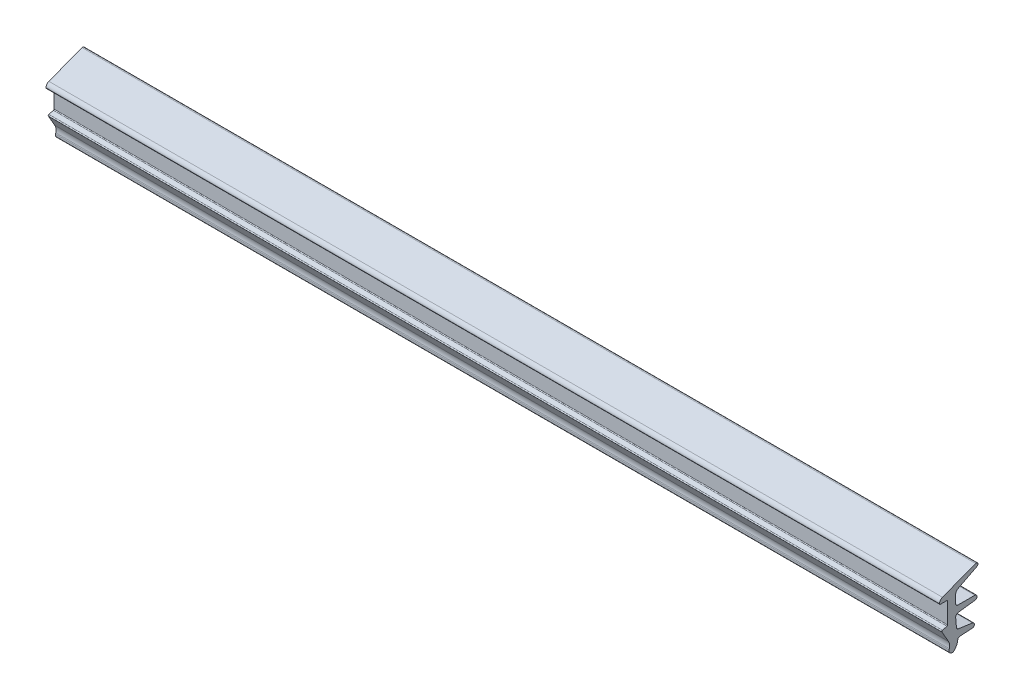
ISO-10303-21;
HEADER;
FILE_DESCRIPTION(('STEP AP214'),'2;1');
FILE_NAME('part.step','',(''),(''),'','','');
FILE_SCHEMA(('AUTOMOTIVE_DESIGN { 1 0 10303 214 1 1 1 1 }'));
ENDSEC;
DATA;
#1=APPLICATION_CONTEXT('core data for automotive mechanical design processes');
#2=APPLICATION_PROTOCOL_DEFINITION('international standard','automotive_design',2000,#1);
#3=PRODUCT_CONTEXT('',#1,'mechanical');
#4=PRODUCT('Part','Part','',(#3));
#5=PRODUCT_RELATED_PRODUCT_CATEGORY('part','',(#4));
#6=PRODUCT_DEFINITION_FORMATION('','',#4);
#7=PRODUCT_DEFINITION_CONTEXT('part definition',#1,'design');
#8=PRODUCT_DEFINITION('design','',#6,#7);
#9=PRODUCT_DEFINITION_SHAPE('','',#8);
#10=(LENGTH_UNIT() NAMED_UNIT(*) SI_UNIT(.MILLI.,.METRE.));
#11=(NAMED_UNIT(*) PLANE_ANGLE_UNIT() SI_UNIT($,.RADIAN.));
#12=(NAMED_UNIT(*) SI_UNIT($,.STERADIAN.) SOLID_ANGLE_UNIT());
#13=UNCERTAINTY_MEASURE_WITH_UNIT(LENGTH_MEASURE(1.E-05),#10,'distance_accuracy_value','');
#14=(GEOMETRIC_REPRESENTATION_CONTEXT(3) GLOBAL_UNCERTAINTY_ASSIGNED_CONTEXT((#13)) GLOBAL_UNIT_ASSIGNED_CONTEXT((#10,
#11,#12)) REPRESENTATION_CONTEXT('',''));
#15=CARTESIAN_POINT('',(0.,0.,0.));
#16=DIRECTION('',(0.,0.,1.));
#17=DIRECTION('',(1.,0.,0.));
#18=AXIS2_PLACEMENT_3D('',#15,#16,#17);
#19=CARTESIAN_POINT('',(200.,3.51865147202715,-1.84515950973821));
#20=DIRECTION('',(-1.,0.,0.));
#21=DIRECTION('',(0.,0.,1.));
#22=AXIS2_PLACEMENT_3D('',#19,#20,#21);
#23=CYLINDRICAL_SURFACE('',#22,0.999999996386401);
#24=CARTESIAN_POINT('',(0.,3.51865147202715,-1.84515950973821));
#25=DIRECTION('',(-1.,0.,0.));
#26=DIRECTION('',(0.,0.,-1.));
#27=AXIS2_PLACEMENT_3D('',#24,#25,#26);
#28=CIRCLE('',#27,0.999999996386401);
#29=CARTESIAN_POINT('',(0.,3.51865147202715,-0.845159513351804));
#30=VERTEX_POINT('',#29);
#31=CARTESIAN_POINT('',(0.,4.40965799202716,-1.3911690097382));
#32=VERTEX_POINT('',#31);
#33=EDGE_CURVE('E363',#30,#32,#28,.T.);
#34=ORIENTED_EDGE('',*,*,#33,.T.);
#35=DIRECTION('',(-1.,0.,0.));
#36=VECTOR('',#35,1.);
#37=CARTESIAN_POINT('',(200.,4.40965799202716,-1.3911690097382));
#38=LINE('',#37,#36);
#39=CARTESIAN_POINT('',(200.,4.40965799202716,-1.3911690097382));
#40=VERTEX_POINT('',#39);
#41=EDGE_CURVE('E12',#40,#32,#38,.T.);
#42=ORIENTED_EDGE('',*,*,#41,.F.);
#43=CARTESIAN_POINT('',(200.,3.51865147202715,-1.84515950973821));
#44=DIRECTION('',(-1.,0.,0.));
#45=DIRECTION('',(0.,0.,-1.));
#46=AXIS2_PLACEMENT_3D('',#43,#44,#45);
#47=CIRCLE('',#46,0.999999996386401);
#48=CARTESIAN_POINT('',(200.,3.51865147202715,-0.845159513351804));
#49=VERTEX_POINT('',#48);
#50=EDGE_CURVE('E448',#49,#40,#47,.T.);
#51=ORIENTED_EDGE('',*,*,#50,.F.);
#52=DIRECTION('',(-1.,0.,0.));
#53=VECTOR('',#52,1.);
#54=CARTESIAN_POINT('',(200.,3.51865147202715,-0.845159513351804));
#55=LINE('',#54,#53);
#56=EDGE_CURVE('E359',#49,#30,#55,.T.);
#57=ORIENTED_EDGE('',*,*,#56,.T.);
#58=EDGE_LOOP('',(#34,#42,#51,#57));
#59=FACE_BOUND('',#58,.T.);
#60=ADVANCED_FACE('F136',(#59),#23,.F.);
#61=CARTESIAN_POINT('',(200.,4.40965799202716,-1.3911690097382));
#62=DIRECTION('',(0.,0.891006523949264,0.453990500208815));
#63=DIRECTION('',(0.,-0.453990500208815,0.891006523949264));
#64=AXIS2_PLACEMENT_3D('',#61,#62,#63);
#65=PLANE('',#64);
#66=DIRECTION('',(0.,0.453990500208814,-0.891006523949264));
#67=VECTOR('',#66,1.);
#68=CARTESIAN_POINT('',(0.,4.40965799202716,-1.3911690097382));
#69=LINE('',#68,#67);
#70=CARTESIAN_POINT('',(0.,6.56779721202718,-5.6267557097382));
#71=VERTEX_POINT('',#70);
#72=EDGE_CURVE('E367',#32,#71,#69,.T.);
#73=ORIENTED_EDGE('',*,*,#72,.T.);
#74=DIRECTION('',(-1.,0.,0.));
#75=VECTOR('',#74,1.);
#76=CARTESIAN_POINT('',(200.,6.56779721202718,-5.6267557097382));
#77=LINE('',#76,#75);
#78=CARTESIAN_POINT('',(200.,6.56779721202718,-5.6267557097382));
#79=VERTEX_POINT('',#78);
#80=EDGE_CURVE('E145',#79,#71,#77,.T.);
#81=ORIENTED_EDGE('',*,*,#80,.F.);
#82=DIRECTION('',(0.,0.453990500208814,-0.891006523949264));
#83=VECTOR('',#82,1.);
#84=CARTESIAN_POINT('',(200.,4.40965799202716,-1.3911690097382));
#85=LINE('',#84,#83);
#86=EDGE_CURVE('E259',#40,#79,#85,.T.);
#87=ORIENTED_EDGE('',*,*,#86,.F.);
#88=ORIENTED_EDGE('',*,*,#41,.T.);
#89=EDGE_LOOP('',(#73,#81,#87,#88));
#90=FACE_BOUND('',#89,.T.);
#91=ADVANCED_FACE('F661',(#90),#65,.F.);
#92=CARTESIAN_POINT('',(200.,6.92419982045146,-5.44515951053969));
#93=DIRECTION('',(-1.,0.,0.));
#94=DIRECTION('',(0.,0.,1.));
#95=AXIS2_PLACEMENT_3D('',#92,#93,#94);
#96=CYLINDRICAL_SURFACE('',#95,0.39999999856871);
#97=CARTESIAN_POINT('',(0.,6.92419982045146,-5.44515951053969));
#98=DIRECTION('',(1.,0.,0.));
#99=DIRECTION('',(0.,0.,-1.));
#100=AXIS2_PLACEMENT_3D('',#97,#98,#99);
#101=CIRCLE('',#100,0.39999999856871);
#102=CARTESIAN_POINT('',(0.,7.29774157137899,-5.30209812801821));
#103=VERTEX_POINT('',#102);
#104=EDGE_CURVE('E370',#71,#103,#101,.T.);
#105=ORIENTED_EDGE('',*,*,#104,.T.);
#106=DIRECTION('',(-1.,0.,0.));
#107=VECTOR('',#106,1.);
#108=CARTESIAN_POINT('',(200.,7.29774157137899,-5.30209812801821));
#109=LINE('',#108,#107);
#110=CARTESIAN_POINT('',(200.,7.29774157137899,-5.30209812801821));
#111=VERTEX_POINT('',#110);
#112=EDGE_CURVE('E543',#111,#103,#109,.T.);
#113=ORIENTED_EDGE('',*,*,#112,.F.);
#114=CARTESIAN_POINT('',(200.,6.92419982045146,-5.44515951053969));
#115=DIRECTION('',(1.,0.,0.));
#116=DIRECTION('',(0.,0.,-1.));
#117=AXIS2_PLACEMENT_3D('',#114,#115,#116);
#118=CIRCLE('',#117,0.39999999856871);
#119=EDGE_CURVE('E553',#79,#111,#118,.T.);
#120=ORIENTED_EDGE('',*,*,#119,.F.);
#121=ORIENTED_EDGE('',*,*,#80,.T.);
#122=EDGE_LOOP('',(#105,#113,#120,#121));
#123=FACE_BOUND('',#122,.T.);
#124=ADVANCED_FACE('F551',(#123),#96,.T.);
#125=CARTESIAN_POINT('',(200.,7.29774157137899,-5.30209812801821));
#126=DIRECTION('',(0.,-0.933854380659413,-0.357653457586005));
#127=DIRECTION('',(0.,0.357653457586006,-0.933854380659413));
#128=AXIS2_PLACEMENT_3D('',#125,#126,#127);
#129=PLANE('',#128);
#130=DIRECTION('',(0.,-0.357653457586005,0.933854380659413));
#131=VECTOR('',#130,1.);
#132=CARTESIAN_POINT('',(0.,7.29774157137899,-5.30209812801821));
#133=LINE('',#132,#131);
#134=CARTESIAN_POINT('',(0.,4.45805420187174,2.11249394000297));
#135=VERTEX_POINT('',#134);
#136=EDGE_CURVE('E373',#103,#135,#133,.T.);
#137=ORIENTED_EDGE('',*,*,#136,.T.);
#138=DIRECTION('',(-1.,0.,0.));
#139=VECTOR('',#138,1.);
#140=CARTESIAN_POINT('',(200.,4.45805420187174,2.11249394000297));
#141=LINE('',#140,#139);
#142=CARTESIAN_POINT('',(200.,4.45805420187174,2.11249394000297));
#143=VERTEX_POINT('',#142);
#144=EDGE_CURVE('E539',#143,#135,#141,.T.);
#145=ORIENTED_EDGE('',*,*,#144,.F.);
#146=DIRECTION('',(0.,-0.357653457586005,0.933854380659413));
#147=VECTOR('',#146,1.);
#148=CARTESIAN_POINT('',(200.,7.29774157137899,-5.30209812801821));
#149=LINE('',#148,#147);
#150=EDGE_CURVE('E572',#111,#143,#149,.T.);
#151=ORIENTED_EDGE('',*,*,#150,.F.);
#152=ORIENTED_EDGE('',*,*,#112,.T.);
#153=EDGE_LOOP('',(#137,#145,#151,#152));
#154=FACE_BOUND('',#153,.T.);
#155=ADVANCED_FACE('F562',(#154),#129,.F.);
#156=CARTESIAN_POINT('',(200.,3.52419982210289,1.75484048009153));
#157=DIRECTION('',(-1.,0.,0.));
#158=DIRECTION('',(0.,0.,1.));
#159=AXIS2_PLACEMENT_3D('',#156,#157,#158);
#160=CYLINDRICAL_SURFACE('',#159,1.00000000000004);
#161=CARTESIAN_POINT('',(0.,3.52419982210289,1.75484048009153));
#162=DIRECTION('',(1.,0.,0.));
#163=DIRECTION('',(0.,0.,-1.));
#164=AXIS2_PLACEMENT_3D('',#161,#162,#163);
#165=CIRCLE('',#164,1.00000000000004);
#166=CARTESIAN_POINT('',(0.,3.5241998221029,2.75484048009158));
#167=VERTEX_POINT('',#166);
#168=EDGE_CURVE('E376',#135,#167,#165,.T.);
#169=ORIENTED_EDGE('',*,*,#168,.T.);
#170=DIRECTION('',(-1.,0.,0.));
#171=VECTOR('',#170,1.);
#172=CARTESIAN_POINT('',(200.,3.5241998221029,2.75484048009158));
#173=LINE('',#172,#171);
#174=CARTESIAN_POINT('',(200.,3.5241998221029,2.75484048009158));
#175=VERTEX_POINT('',#174);
#176=EDGE_CURVE('E535',#175,#167,#173,.T.);
#177=ORIENTED_EDGE('',*,*,#176,.F.);
#178=CARTESIAN_POINT('',(200.,3.52419982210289,1.75484048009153));
#179=DIRECTION('',(1.,0.,0.));
#180=DIRECTION('',(0.,0.,-1.));
#181=AXIS2_PLACEMENT_3D('',#178,#179,#180);
#182=CIRCLE('',#181,1.00000000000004);
#183=EDGE_CURVE('E568',#143,#175,#182,.T.);
#184=ORIENTED_EDGE('',*,*,#183,.F.);
#185=ORIENTED_EDGE('',*,*,#144,.T.);
#186=EDGE_LOOP('',(#169,#177,#184,#185));
#187=FACE_BOUND('',#186,.T.);
#188=ADVANCED_FACE('F566',(#187),#160,.T.);
#189=CARTESIAN_POINT('',(200.,3.52419982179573,2.55484048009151));
#190=DIRECTION('',(-1.,0.,0.));
#191=DIRECTION('',(0.,0.,1.));
#192=AXIS2_PLACEMENT_3D('',#189,#190,#191);
#193=CYLINDRICAL_SURFACE('',#192,0.200000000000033);
#194=CARTESIAN_POINT('',(0.,3.52419982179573,2.55484048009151));
#195=DIRECTION('',(1.,0.,0.));
#196=DIRECTION('',(0.,0.,-1.));
#197=AXIS2_PLACEMENT_3D('',#194,#195,#196);
#198=CIRCLE('',#197,0.200000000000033);
#199=CARTESIAN_POINT('',(0.,3.3241998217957,2.55484048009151));
#200=VERTEX_POINT('',#199);
#201=EDGE_CURVE('E379',#167,#200,#198,.T.);
#202=ORIENTED_EDGE('',*,*,#201,.T.);
#203=DIRECTION('',(-1.,0.,0.));
#204=VECTOR('',#203,1.);
#205=CARTESIAN_POINT('',(200.,3.3241998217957,2.55484048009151));
#206=LINE('',#205,#204);
#207=CARTESIAN_POINT('',(200.,3.3241998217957,2.55484048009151));
#208=VERTEX_POINT('',#207);
#209=EDGE_CURVE('E531',#208,#200,#206,.T.);
#210=ORIENTED_EDGE('',*,*,#209,.F.);
#211=CARTESIAN_POINT('',(200.,3.52419982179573,2.55484048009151));
#212=DIRECTION('',(1.,0.,0.));
#213=DIRECTION('',(0.,0.,-1.));
#214=AXIS2_PLACEMENT_3D('',#211,#212,#213);
#215=CIRCLE('',#214,0.200000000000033);
#216=EDGE_CURVE('E571',#175,#208,#215,.T.);
#217=ORIENTED_EDGE('',*,*,#216,.F.);
#218=ORIENTED_EDGE('',*,*,#176,.T.);
#219=EDGE_LOOP('',(#202,#210,#217,#218));
#220=FACE_BOUND('',#219,.T.);
#221=ADVANCED_FACE('F674',(#220),#193,.T.);
#222=CARTESIAN_POINT('',(200.,3.32419982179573,2.55484048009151));
#223=DIRECTION('',(0.,1.,0.));
#224=DIRECTION('',(0.,0.,1.));
#225=AXIS2_PLACEMENT_3D('',#222,#223,#224);
#226=PLANE('',#225);
#227=DIRECTION('',(0.,0.,-1.));
#228=VECTOR('',#227,1.);
#229=CARTESIAN_POINT('',(0.,3.32419982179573,2.55484048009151));
#230=LINE('',#229,#228);
#231=CARTESIAN_POINT('',(0.,3.32419982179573,1.15484046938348));
#232=VERTEX_POINT('',#231);
#233=EDGE_CURVE('E382',#200,#232,#230,.T.);
#234=ORIENTED_EDGE('',*,*,#233,.T.);
#235=DIRECTION('',(-1.,0.,0.));
#236=VECTOR('',#235,1.);
#237=CARTESIAN_POINT('',(200.,3.32419982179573,1.15484046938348));
#238=LINE('',#237,#236);
#239=CARTESIAN_POINT('',(200.,3.32419982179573,1.15484046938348));
#240=VERTEX_POINT('',#239);
#241=EDGE_CURVE('E527',#240,#232,#238,.T.);
#242=ORIENTED_EDGE('',*,*,#241,.F.);
#243=DIRECTION('',(0.,0.,-1.));
#244=VECTOR('',#243,1.);
#245=CARTESIAN_POINT('',(200.,3.32419982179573,2.55484048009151));
#246=LINE('',#245,#244);
#247=EDGE_CURVE('E576',#208,#240,#246,.T.);
#248=ORIENTED_EDGE('',*,*,#247,.F.);
#249=ORIENTED_EDGE('',*,*,#209,.T.);
#250=EDGE_LOOP('',(#234,#242,#248,#249));
#251=FACE_BOUND('',#250,.T.);
#252=ADVANCED_FACE('F677',(#251),#226,.F.);
#253=CARTESIAN_POINT('',(200.,3.12419982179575,1.15484046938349));
#254=DIRECTION('',(-1.,0.,0.));
#255=DIRECTION('',(0.,0.,1.));
#256=AXIS2_PLACEMENT_3D('',#253,#254,#255);
#257=CYLINDRICAL_SURFACE('',#256,0.199999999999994);
#258=CARTESIAN_POINT('',(0.,3.12419982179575,1.15484046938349));
#259=DIRECTION('',(-1.,0.,0.));
#260=DIRECTION('',(0.,0.,-1.));
#261=AXIS2_PLACEMENT_3D('',#258,#259,#260);
#262=CIRCLE('',#261,0.199999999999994);
#263=CARTESIAN_POINT('',(0.,3.12419982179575,0.954840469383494));
#264=VERTEX_POINT('',#263);
#265=EDGE_CURVE('E385',#232,#264,#262,.T.);
#266=ORIENTED_EDGE('',*,*,#265,.T.);
#267=DIRECTION('',(-1.,0.,0.));
#268=VECTOR('',#267,1.);
#269=CARTESIAN_POINT('',(200.,3.12419982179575,0.954840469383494));
#270=LINE('',#269,#268);
#271=CARTESIAN_POINT('',(200.,3.12419982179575,0.954840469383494));
#272=VERTEX_POINT('',#271);
#273=EDGE_CURVE('E523',#272,#264,#270,.T.);
#274=ORIENTED_EDGE('',*,*,#273,.F.);
#275=CARTESIAN_POINT('',(200.,3.12419982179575,1.15484046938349));
#276=DIRECTION('',(-1.,0.,0.));
#277=DIRECTION('',(0.,0.,-1.));
#278=AXIS2_PLACEMENT_3D('',#275,#276,#277);
#279=CIRCLE('',#278,0.199999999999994);
#280=EDGE_CURVE('E583',#240,#272,#279,.T.);
#281=ORIENTED_EDGE('',*,*,#280,.F.);
#282=ORIENTED_EDGE('',*,*,#241,.T.);
#283=EDGE_LOOP('',(#266,#274,#281,#282));
#284=FACE_BOUND('',#283,.T.);
#285=ADVANCED_FACE('F681',(#284),#257,.F.);
#286=CARTESIAN_POINT('',(200.,3.12419982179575,0.954840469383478));
#287=DIRECTION('',(0.,0.,-1.));
#288=DIRECTION('',(-1.,0.,0.));
#289=AXIS2_PLACEMENT_3D('',#286,#287,#288);
#290=PLANE('',#289);
#291=DIRECTION('',(0.,-1.,0.));
#292=VECTOR('',#291,1.);
#293=CARTESIAN_POINT('',(0.,3.12419982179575,0.954840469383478));
#294=LINE('',#293,#292);
#295=CARTESIAN_POINT('',(0.,-1.47580017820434,0.954840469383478));
#296=VERTEX_POINT('',#295);
#297=EDGE_CURVE('E388',#264,#296,#294,.T.);
#298=ORIENTED_EDGE('',*,*,#297,.T.);
#299=DIRECTION('',(-1.,0.,0.));
#300=VECTOR('',#299,1.);
#301=CARTESIAN_POINT('',(200.,-1.47580017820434,0.954840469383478));
#302=LINE('',#301,#300);
#303=CARTESIAN_POINT('',(200.,-1.47580017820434,0.954840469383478));
#304=VERTEX_POINT('',#303);
#305=EDGE_CURVE('E519',#304,#296,#302,.T.);
#306=ORIENTED_EDGE('',*,*,#305,.F.);
#307=DIRECTION('',(0.,-1.,0.));
#308=VECTOR('',#307,1.);
#309=CARTESIAN_POINT('',(200.,3.12419982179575,0.954840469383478));
#310=LINE('',#309,#308);
#311=EDGE_CURVE('E586',#272,#304,#310,.T.);
#312=ORIENTED_EDGE('',*,*,#311,.F.);
#313=ORIENTED_EDGE('',*,*,#273,.T.);
#314=EDGE_LOOP('',(#298,#306,#312,#313));
#315=FACE_BOUND('',#314,.T.);
#316=ADVANCED_FACE('F685',(#315),#290,.F.);
#317=CARTESIAN_POINT('',(200.,-1.47580017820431,1.15484047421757));
#318=DIRECTION('',(-1.,0.,0.));
#319=DIRECTION('',(0.,0.,1.));
#320=AXIS2_PLACEMENT_3D('',#317,#318,#319);
#321=CYLINDRICAL_SURFACE('',#320,0.200000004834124);
#322=CARTESIAN_POINT('',(0.,-1.47580017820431,1.15484047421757));
#323=DIRECTION('',(-1.,0.,0.));
#324=DIRECTION('',(0.,0.,-1.));
#325=AXIS2_PLACEMENT_3D('',#322,#323,#324);
#326=CIRCLE('',#325,0.200000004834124);
#327=CARTESIAN_POINT('',(0.,-1.66898534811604,1.10307666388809));
#328=VERTEX_POINT('',#327);
#329=EDGE_CURVE('E391',#296,#328,#326,.T.);
#330=ORIENTED_EDGE('',*,*,#329,.T.);
#331=DIRECTION('',(-1.,0.,0.));
#332=VECTOR('',#331,1.);
#333=CARTESIAN_POINT('',(200.,-1.66898534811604,1.10307666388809));
#334=LINE('',#333,#332);
#335=CARTESIAN_POINT('',(200.,-1.66898534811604,1.10307666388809));
#336=VERTEX_POINT('',#335);
#337=EDGE_CURVE('E515',#336,#328,#334,.T.);
#338=ORIENTED_EDGE('',*,*,#337,.F.);
#339=CARTESIAN_POINT('',(200.,-1.47580017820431,1.15484047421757));
#340=DIRECTION('',(-1.,0.,0.));
#341=DIRECTION('',(0.,0.,-1.));
#342=AXIS2_PLACEMENT_3D('',#339,#340,#341);
#343=CIRCLE('',#342,0.200000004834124);
#344=EDGE_CURVE('E589',#304,#336,#343,.T.);
#345=ORIENTED_EDGE('',*,*,#344,.F.);
#346=ORIENTED_EDGE('',*,*,#305,.T.);
#347=EDGE_LOOP('',(#330,#338,#345,#346));
#348=FACE_BOUND('',#347,.T.);
#349=ADVANCED_FACE('F689',(#348),#321,.F.);
#350=CARTESIAN_POINT('',(200.,-1.66898534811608,1.10307666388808));
#351=DIRECTION('',(0.,-0.965925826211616,-0.258819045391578));
#352=DIRECTION('',(0.,0.258819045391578,-0.965925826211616));
#353=AXIS2_PLACEMENT_3D('',#350,#351,#352);
#354=PLANE('',#353);
#355=DIRECTION('',(0.,-0.258819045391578,0.965925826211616));
#356=VECTOR('',#355,1.);
#357=CARTESIAN_POINT('',(0.,-1.66898534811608,1.10307666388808));
#358=LINE('',#357,#356);
#359=CARTESIAN_POINT('',(0.,-1.93787976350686,2.10660428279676));
#360=VERTEX_POINT('',#359);
#361=EDGE_CURVE('E394',#328,#360,#358,.T.);
#362=ORIENTED_EDGE('',*,*,#361,.T.);
#363=DIRECTION('',(-1.,0.,0.));
#364=VECTOR('',#363,1.);
#365=CARTESIAN_POINT('',(200.,-1.93787976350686,2.10660428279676));
#366=LINE('',#365,#364);
#367=CARTESIAN_POINT('',(200.,-1.93787976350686,2.10660428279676));
#368=VERTEX_POINT('',#367);
#369=EDGE_CURVE('E511',#368,#360,#366,.T.);
#370=ORIENTED_EDGE('',*,*,#369,.F.);
#371=DIRECTION('',(0.,-0.258819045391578,0.965925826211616));
#372=VECTOR('',#371,1.);
#373=CARTESIAN_POINT('',(200.,-1.66898534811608,1.10307666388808));
#374=LINE('',#373,#372);
#375=EDGE_CURVE('E592',#336,#368,#374,.T.);
#376=ORIENTED_EDGE('',*,*,#375,.F.);
#377=ORIENTED_EDGE('',*,*,#337,.T.);
#378=EDGE_LOOP('',(#362,#370,#376,#377));
#379=FACE_BOUND('',#378,.T.);
#380=ADVANCED_FACE('F693',(#379),#354,.F.);
#381=CARTESIAN_POINT('',(200.,-2.13106492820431,2.05484047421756));
#382=DIRECTION('',(-1.,0.,0.));
#383=DIRECTION('',(0.,0.,1.));
#384=AXIS2_PLACEMENT_3D('',#381,#382,#383);
#385=CYLINDRICAL_SURFACE('',#384,0.199999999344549);
#386=CARTESIAN_POINT('',(0.,-2.13106492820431,2.05484047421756));
#387=DIRECTION('',(1.,0.,0.));
#388=DIRECTION('',(0.,0.,-1.));
#389=AXIS2_PLACEMENT_3D('',#386,#387,#388);
#390=CIRCLE('',#389,0.199999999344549);
#391=CARTESIAN_POINT('',(0.,-2.23106492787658,2.22804555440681));
#392=VERTEX_POINT('',#391);
#393=EDGE_CURVE('E397',#360,#392,#390,.T.);
#394=ORIENTED_EDGE('',*,*,#393,.T.);
#395=DIRECTION('',(-1.,0.,0.));
#396=VECTOR('',#395,1.);
#397=CARTESIAN_POINT('',(200.,-2.23106492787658,2.22804555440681));
#398=LINE('',#397,#396);
#399=CARTESIAN_POINT('',(200.,-2.23106492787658,2.22804555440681));
#400=VERTEX_POINT('',#399);
#401=EDGE_CURVE('E507',#400,#392,#398,.T.);
#402=ORIENTED_EDGE('',*,*,#401,.F.);
#403=CARTESIAN_POINT('',(200.,-2.13106492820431,2.05484047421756));
#404=DIRECTION('',(1.,0.,0.));
#405=DIRECTION('',(0.,0.,-1.));
#406=AXIS2_PLACEMENT_3D('',#403,#404,#405);
#407=CIRCLE('',#406,0.199999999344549);
#408=EDGE_CURVE('E595',#368,#400,#407,.T.);
#409=ORIENTED_EDGE('',*,*,#408,.F.);
#410=ORIENTED_EDGE('',*,*,#369,.T.);
#411=EDGE_LOOP('',(#394,#402,#409,#410));
#412=FACE_BOUND('',#411,.T.);
#413=ADVANCED_FACE('F697',(#412),#385,.T.);
#414=CARTESIAN_POINT('',(200.,-2.2310649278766,2.22804555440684));
#415=DIRECTION('',(0.,0.5,-0.866025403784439));
#416=DIRECTION('',(0.,0.866025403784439,0.5));
#417=AXIS2_PLACEMENT_3D('',#414,#415,#416);
#418=PLANE('',#417);
#419=DIRECTION('',(0.,-0.866025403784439,-0.5));
#420=VECTOR('',#419,1.);
#421=CARTESIAN_POINT('',(0.,-2.2310649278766,2.22804555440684));
#422=LINE('',#421,#420);
#423=CARTESIAN_POINT('',(0.,-4.75445968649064,0.771162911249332));
#424=VERTEX_POINT('',#423);
#425=EDGE_CURVE('E400',#392,#424,#422,.T.);
#426=ORIENTED_EDGE('',*,*,#425,.T.);
#427=DIRECTION('',(-1.,0.,0.));
#428=VECTOR('',#427,1.);
#429=CARTESIAN_POINT('',(200.,-4.75445968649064,0.771162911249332));
#430=LINE('',#429,#428);
#431=CARTESIAN_POINT('',(200.,-4.75445968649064,0.771162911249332));
#432=VERTEX_POINT('',#431);
#433=EDGE_CURVE('E503',#432,#424,#430,.T.);
#434=ORIENTED_EDGE('',*,*,#433,.F.);
#435=DIRECTION('',(0.,-0.866025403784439,-0.5));
#436=VECTOR('',#435,1.);
#437=CARTESIAN_POINT('',(200.,-2.2310649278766,2.22804555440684));
#438=LINE('',#437,#436);
#439=EDGE_CURVE('E598',#400,#432,#438,.T.);
#440=ORIENTED_EDGE('',*,*,#439,.F.);
#441=ORIENTED_EDGE('',*,*,#401,.T.);
#442=EDGE_LOOP('',(#426,#434,#440,#441));
#443=FACE_BOUND('',#442,.T.);
#444=ADVANCED_FACE('F701',(#443),#418,.F.);
#445=CARTESIAN_POINT('',(200.,-5.75445968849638,2.50321371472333));
#446=DIRECTION('',(-1.,0.,0.));
#447=DIRECTION('',(0.,0.,1.));
#448=AXIS2_PLACEMENT_3D('',#445,#446,#447);
#449=CYLINDRICAL_SURFACE('',#448,1.99999999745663);
#450=CARTESIAN_POINT('',(0.,-5.75445968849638,2.50321371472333));
#451=DIRECTION('',(-1.,0.,0.));
#452=DIRECTION('',(0.,0.,-1.));
#453=AXIS2_PLACEMENT_3D('',#450,#451,#452);
#454=CIRCLE('',#453,1.99999999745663);
#455=CARTESIAN_POINT('',(0.,-6.27209789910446,0.571362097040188));
#456=VERTEX_POINT('',#455);
#457=EDGE_CURVE('E403',#424,#456,#454,.T.);
#458=ORIENTED_EDGE('',*,*,#457,.T.);
#459=DIRECTION('',(-1.,0.,0.));
#460=VECTOR('',#459,1.);
#461=CARTESIAN_POINT('',(200.,-6.27209789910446,0.571362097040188));
#462=LINE('',#461,#460);
#463=CARTESIAN_POINT('',(200.,-6.27209789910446,0.571362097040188));
#464=VERTEX_POINT('',#463);
#465=EDGE_CURVE('E499',#464,#456,#462,.T.);
#466=ORIENTED_EDGE('',*,*,#465,.F.);
#467=CARTESIAN_POINT('',(200.,-5.75445968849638,2.50321371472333));
#468=DIRECTION('',(-1.,0.,0.));
#469=DIRECTION('',(0.,0.,-1.));
#470=AXIS2_PLACEMENT_3D('',#467,#468,#469);
#471=CIRCLE('',#470,1.99999999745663);
#472=EDGE_CURVE('E601',#432,#464,#471,.T.);
#473=ORIENTED_EDGE('',*,*,#472,.F.);
#474=ORIENTED_EDGE('',*,*,#433,.T.);
#475=EDGE_LOOP('',(#458,#466,#473,#474));
#476=FACE_BOUND('',#475,.T.);
#477=ADVANCED_FACE('F705',(#476),#449,.F.);
#478=CARTESIAN_POINT('',(200.,-6.27209789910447,0.57136209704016));
#479=DIRECTION('',(0.,-0.25881910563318,-0.965925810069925));
#480=DIRECTION('',(0.,0.965925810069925,-0.25881910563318));
#481=AXIS2_PLACEMENT_3D('',#478,#479,#480);
#482=PLANE('',#481);
#483=DIRECTION('',(0.,-0.965925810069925,0.25881910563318));
#484=VECTOR('',#483,1.);
#485=CARTESIAN_POINT('',(0.,-6.27209789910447,0.57136209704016));
#486=LINE('',#485,#484);
#487=CARTESIAN_POINT('',(0.,-6.49462684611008,0.630988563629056));
#488=VERTEX_POINT('',#487);
#489=EDGE_CURVE('E406',#456,#488,#486,.T.);
#490=ORIENTED_EDGE('',*,*,#489,.T.);
#491=DIRECTION('',(-1.,0.,0.));
#492=VECTOR('',#491,1.);
#493=CARTESIAN_POINT('',(200.,-6.49462684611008,0.630988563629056));
#494=LINE('',#493,#492);
#495=CARTESIAN_POINT('',(200.,-6.49462684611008,0.630988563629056));
#496=VERTEX_POINT('',#495);
#497=EDGE_CURVE('E495',#496,#488,#494,.T.);
#498=ORIENTED_EDGE('',*,*,#497,.F.);
#499=DIRECTION('',(0.,-0.965925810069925,0.25881910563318));
#500=VECTOR('',#499,1.);
#501=CARTESIAN_POINT('',(200.,-6.27209789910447,0.57136209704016));
#502=LINE('',#501,#500);
#503=EDGE_CURVE('E604',#464,#496,#502,.T.);
#504=ORIENTED_EDGE('',*,*,#503,.F.);
#505=ORIENTED_EDGE('',*,*,#465,.T.);
#506=EDGE_LOOP('',(#490,#498,#504,#505));
#507=FACE_BOUND('',#506,.T.);
#508=ADVANCED_FACE('F709',(#507),#482,.F.);
#509=CARTESIAN_POINT('',(200.,-6.67580017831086,-0.045159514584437));
#510=DIRECTION('',(-1.,0.,0.));
#511=DIRECTION('',(0.,0.,1.));
#512=AXIS2_PLACEMENT_3D('',#509,#510,#511);
#513=CYLINDRICAL_SURFACE('',#512,0.699999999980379);
#514=CARTESIAN_POINT('',(0.,-6.67580017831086,-0.045159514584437));
#515=DIRECTION('',(1.,0.,0.));
#516=DIRECTION('',(0.,0.,-1.));
#517=AXIS2_PLACEMENT_3D('',#514,#515,#516);
#518=CIRCLE('',#517,0.699999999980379);
#519=CARTESIAN_POINT('',(0.,-7.13868086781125,-0.570270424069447));
#520=VERTEX_POINT('',#519);
#521=EDGE_CURVE('E409',#488,#520,#518,.T.);
#522=ORIENTED_EDGE('',*,*,#521,.T.);
#523=DIRECTION('',(-1.,0.,0.));
#524=VECTOR('',#523,1.);
#525=CARTESIAN_POINT('',(200.,-7.13868086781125,-0.570270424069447));
#526=LINE('',#525,#524);
#527=CARTESIAN_POINT('',(200.,-7.13868086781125,-0.570270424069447));
#528=VERTEX_POINT('',#527);
#529=EDGE_CURVE('E491',#528,#520,#526,.T.);
#530=ORIENTED_EDGE('',*,*,#529,.F.);
#531=CARTESIAN_POINT('',(200.,-6.67580017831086,-0.045159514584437));
#532=DIRECTION('',(1.,0.,0.));
#533=DIRECTION('',(0.,0.,-1.));
#534=AXIS2_PLACEMENT_3D('',#531,#532,#533);
#535=CIRCLE('',#534,0.699999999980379);
#536=EDGE_CURVE('E607',#496,#528,#535,.T.);
#537=ORIENTED_EDGE('',*,*,#536,.F.);
#538=ORIENTED_EDGE('',*,*,#497,.T.);
#539=EDGE_LOOP('',(#522,#530,#537,#538));
#540=FACE_BOUND('',#539,.T.);
#541=ADVANCED_FACE('F713',(#540),#513,.T.);
#542=CARTESIAN_POINT('',(200.,-5.15656757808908,1.57277499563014));
#543=DIRECTION('',(-1.,0.,0.));
#544=DIRECTION('',(0.,0.,1.));
#545=AXIS2_PLACEMENT_3D('',#542,#543,#544);
#546=CYLINDRICAL_SURFACE('',#545,2.91914658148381);
#547=CARTESIAN_POINT('',(0.,-5.15656757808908,1.57277499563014));
#548=DIRECTION('',(1.,0.,0.));
#549=DIRECTION('',(0.,0.,-1.));
#550=AXIS2_PLACEMENT_3D('',#547,#548,#549);
#551=CIRCLE('',#550,2.91914658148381);
#552=CARTESIAN_POINT('',(0.,-5.48741306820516,-1.32756257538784));
#553=VERTEX_POINT('',#552);
#554=EDGE_CURVE('E412',#520,#553,#551,.T.);
#555=ORIENTED_EDGE('',*,*,#554,.T.);
#556=DIRECTION('',(-1.,0.,0.));
#557=VECTOR('',#556,1.);
#558=CARTESIAN_POINT('',(200.,-5.48741306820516,-1.32756257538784));
#559=LINE('',#558,#557);
#560=CARTESIAN_POINT('',(200.,-5.48741306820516,-1.32756257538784));
#561=VERTEX_POINT('',#560);
#562=EDGE_CURVE('E487',#561,#553,#559,.T.);
#563=ORIENTED_EDGE('',*,*,#562,.F.);
#564=CARTESIAN_POINT('',(200.,-5.15656757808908,1.57277499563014));
#565=DIRECTION('',(1.,0.,0.));
#566=DIRECTION('',(0.,0.,-1.));
#567=AXIS2_PLACEMENT_3D('',#564,#565,#566);
#568=CIRCLE('',#567,2.91914658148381);
#569=EDGE_CURVE('E610',#528,#561,#568,.T.);
#570=ORIENTED_EDGE('',*,*,#569,.F.);
#571=ORIENTED_EDGE('',*,*,#529,.T.);
#572=EDGE_LOOP('',(#555,#563,#570,#571));
#573=FACE_BOUND('',#572,.T.);
#574=ADVANCED_FACE('F717',(#573),#546,.T.);
#575=CARTESIAN_POINT('',(200.,-5.54408125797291,-1.82434091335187));
#576=DIRECTION('',(-1.,0.,0.));
#577=DIRECTION('',(0.,0.,1.));
#578=AXIS2_PLACEMENT_3D('',#575,#576,#577);
#579=CYLINDRICAL_SURFACE('',#578,0.500000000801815);
#580=CARTESIAN_POINT('',(0.,-5.54408125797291,-1.82434091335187));
#581=DIRECTION('',(-1.,0.,0.));
#582=DIRECTION('',(0.,0.,-1.));
#583=AXIS2_PLACEMENT_3D('',#580,#581,#582);
#584=CIRCLE('',#583,0.500000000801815);
#585=CARTESIAN_POINT('',(0.,-5.04501385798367,-1.79381664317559));
#586=VERTEX_POINT('',#585);
#587=EDGE_CURVE('E415',#553,#586,#584,.T.);
#588=ORIENTED_EDGE('',*,*,#587,.T.);
#589=DIRECTION('',(-1.,0.,0.));
#590=VECTOR('',#589,1.);
#591=CARTESIAN_POINT('',(200.,-5.04501385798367,-1.79381664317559));
#592=LINE('',#591,#590);
#593=CARTESIAN_POINT('',(200.,-5.04501385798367,-1.79381664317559));
#594=VERTEX_POINT('',#593);
#595=EDGE_CURVE('E483',#594,#586,#592,.T.);
#596=ORIENTED_EDGE('',*,*,#595,.F.);
#597=CARTESIAN_POINT('',(200.,-5.54408125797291,-1.82434091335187));
#598=DIRECTION('',(-1.,0.,0.));
#599=DIRECTION('',(0.,0.,-1.));
#600=AXIS2_PLACEMENT_3D('',#597,#598,#599);
#601=CIRCLE('',#600,0.500000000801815);
#602=EDGE_CURVE('E613',#561,#594,#601,.T.);
#603=ORIENTED_EDGE('',*,*,#602,.F.);
#604=ORIENTED_EDGE('',*,*,#562,.T.);
#605=EDGE_LOOP('',(#588,#596,#603,#604));
#606=FACE_BOUND('',#605,.T.);
#607=ADVANCED_FACE('F721',(#606),#579,.F.);
#608=CARTESIAN_POINT('',(200.,-5.04501385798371,-1.79381664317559));
#609=DIRECTION('',(0.,0.998134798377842,0.061048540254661));
#610=DIRECTION('',(0.,-0.061048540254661,0.998134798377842));
#611=AXIS2_PLACEMENT_3D('',#608,#609,#610);
#612=PLANE('',#611);
#613=DIRECTION('',(0.,0.061048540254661,-0.998134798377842));
#614=VECTOR('',#613,1.);
#615=CARTESIAN_POINT('',(0.,-5.04501385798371,-1.79381664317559));
#616=LINE('',#615,#614);
#617=CARTESIAN_POINT('',(0.,-4.87486757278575,-4.57568378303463));
#618=VERTEX_POINT('',#617);
#619=EDGE_CURVE('E418',#586,#618,#616,.T.);
#620=ORIENTED_EDGE('',*,*,#619,.T.);
#621=DIRECTION('',(-1.,0.,0.));
#622=VECTOR('',#621,1.);
#623=CARTESIAN_POINT('',(200.,-4.87486757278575,-4.57568378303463));
#624=LINE('',#623,#622);
#625=CARTESIAN_POINT('',(200.,-4.87486757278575,-4.57568378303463));
#626=VERTEX_POINT('',#625);
#627=EDGE_CURVE('E479',#626,#618,#624,.T.);
#628=ORIENTED_EDGE('',*,*,#627,.F.);
#629=DIRECTION('',(0.,0.061048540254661,-0.998134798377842));
#630=VECTOR('',#629,1.);
#631=CARTESIAN_POINT('',(200.,-5.04501385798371,-1.79381664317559));
#632=LINE('',#631,#630);
#633=EDGE_CURVE('E616',#594,#626,#632,.T.);
#634=ORIENTED_EDGE('',*,*,#633,.F.);
#635=ORIENTED_EDGE('',*,*,#595,.T.);
#636=EDGE_LOOP('',(#620,#628,#634,#635));
#637=FACE_BOUND('',#636,.T.);
#638=ADVANCED_FACE('F725',(#637),#612,.F.);
#639=CARTESIAN_POINT('',(200.,-4.37580017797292,-4.54515951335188));
#640=DIRECTION('',(-1.,0.,0.));
#641=DIRECTION('',(0.,0.,1.));
#642=AXIS2_PLACEMENT_3D('',#639,#640,#641);
#643=CYLINDRICAL_SURFACE('',#642,0.499999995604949);
#644=CARTESIAN_POINT('',(0.,-4.37580017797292,-4.54515951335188));
#645=DIRECTION('',(1.,0.,0.));
#646=DIRECTION('',(0.,0.,-1.));
#647=AXIS2_PLACEMENT_3D('',#644,#645,#646);
#648=CIRCLE('',#647,0.499999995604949);
#649=CARTESIAN_POINT('',(0.,-3.88066614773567,-4.61474606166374));
#650=VERTEX_POINT('',#649);
#651=EDGE_CURVE('E421',#618,#650,#648,.T.);
#652=ORIENTED_EDGE('',*,*,#651,.T.);
#653=DIRECTION('',(-1.,0.,0.));
#654=VECTOR('',#653,1.);
#655=CARTESIAN_POINT('',(200.,-3.88066614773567,-4.61474606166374));
#656=LINE('',#655,#654);
#657=CARTESIAN_POINT('',(200.,-3.88066614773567,-4.61474606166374));
#658=VERTEX_POINT('',#657);
#659=EDGE_CURVE('E475',#658,#650,#656,.T.);
#660=ORIENTED_EDGE('',*,*,#659,.F.);
#661=CARTESIAN_POINT('',(200.,-4.37580017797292,-4.54515951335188));
#662=DIRECTION('',(1.,0.,0.));
#663=DIRECTION('',(0.,0.,-1.));
#664=AXIS2_PLACEMENT_3D('',#661,#662,#663);
#665=CIRCLE('',#664,0.499999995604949);
#666=EDGE_CURVE('E619',#626,#658,#665,.T.);
#667=ORIENTED_EDGE('',*,*,#666,.F.);
#668=ORIENTED_EDGE('',*,*,#627,.T.);
#669=EDGE_LOOP('',(#652,#660,#667,#668));
#670=FACE_BOUND('',#669,.T.);
#671=ADVANCED_FACE('F729',(#670),#643,.T.);
#672=CARTESIAN_POINT('',(200.,-3.88066614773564,-4.61474606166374));
#673=DIRECTION('',(0.,-0.990268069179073,0.139173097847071));
#674=DIRECTION('',(0.,-0.139173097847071,-0.990268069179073));
#675=AXIS2_PLACEMENT_3D('',#672,#673,#674);
#676=PLANE('',#675);
#677=DIRECTION('',(0.,0.139173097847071,0.990268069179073));
#678=VECTOR('',#677,1.);
#679=CARTESIAN_POINT('',(0.,-3.88066614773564,-4.61474606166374));
#680=LINE('',#679,#678);
#681=CARTESIAN_POINT('',(0.,-3.43603298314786,-1.45101663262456));
#682=VERTEX_POINT('',#681);
#683=EDGE_CURVE('E424',#650,#682,#680,.T.);
#684=ORIENTED_EDGE('',*,*,#683,.T.);
#685=DIRECTION('',(-1.,0.,0.));
#686=VECTOR('',#685,1.);
#687=CARTESIAN_POINT('',(200.,-3.43603298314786,-1.45101663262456));
#688=LINE('',#687,#686);
#689=CARTESIAN_POINT('',(200.,-3.43603298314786,-1.45101663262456));
#690=VERTEX_POINT('',#689);
#691=EDGE_CURVE('E471',#690,#682,#688,.T.);
#692=ORIENTED_EDGE('',*,*,#691,.F.);
#693=DIRECTION('',(0.,0.139173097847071,0.990268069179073));
#694=VECTOR('',#693,1.);
#695=CARTESIAN_POINT('',(200.,-3.88066614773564,-4.61474606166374));
#696=LINE('',#695,#694);
#697=EDGE_CURVE('E622',#658,#690,#696,.T.);
#698=ORIENTED_EDGE('',*,*,#697,.F.);
#699=ORIENTED_EDGE('',*,*,#659,.T.);
#700=EDGE_LOOP('',(#684,#692,#698,#699));
#701=FACE_BOUND('',#700,.T.);
#702=ADVANCED_FACE('F733',(#701),#676,.F.);
#703=CARTESIAN_POINT('',(200.,-2.94089894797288,-1.52060318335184));
#704=DIRECTION('',(-1.,0.,0.));
#705=DIRECTION('',(0.,0.,1.));
#706=AXIS2_PLACEMENT_3D('',#703,#704,#705);
#707=CYLINDRICAL_SURFACE('',#706,0.500000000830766);
#708=CARTESIAN_POINT('',(0.,-2.94089894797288,-1.52060318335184));
#709=DIRECTION('',(-1.,0.,0.));
#710=DIRECTION('',(0.,0.,-1.));
#711=AXIS2_PLACEMENT_3D('',#708,#709,#710);
#712=CIRCLE('',#711,0.500000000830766);
#713=CARTESIAN_POINT('',(0.,-2.98447681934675,-1.02250583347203));
#714=VERTEX_POINT('',#713);
#715=EDGE_CURVE('E427',#682,#714,#712,.T.);
#716=ORIENTED_EDGE('',*,*,#715,.T.);
#717=DIRECTION('',(-1.,0.,0.));
#718=VECTOR('',#717,1.);
#719=CARTESIAN_POINT('',(200.,-2.98447681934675,-1.02250583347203));
#720=LINE('',#719,#718);
#721=CARTESIAN_POINT('',(200.,-2.98447681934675,-1.02250583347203));
#722=VERTEX_POINT('',#721);
#723=EDGE_CURVE('E467',#722,#714,#720,.T.);
#724=ORIENTED_EDGE('',*,*,#723,.F.);
#725=CARTESIAN_POINT('',(200.,-2.94089894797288,-1.52060318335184));
#726=DIRECTION('',(-1.,0.,0.));
#727=DIRECTION('',(0.,0.,-1.));
#728=AXIS2_PLACEMENT_3D('',#725,#726,#727);
#729=CIRCLE('',#728,0.500000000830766);
#730=EDGE_CURVE('E625',#690,#722,#729,.T.);
#731=ORIENTED_EDGE('',*,*,#730,.F.);
#732=ORIENTED_EDGE('',*,*,#691,.T.);
#733=EDGE_LOOP('',(#716,#724,#731,#732));
#734=FACE_BOUND('',#733,.T.);
#735=ADVANCED_FACE('F737',(#734),#707,.F.);
#736=CARTESIAN_POINT('',(200.,-2.98447681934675,-1.02250583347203));
#737=DIRECTION('',(0.,-0.087155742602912,0.996194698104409));
#738=DIRECTION('',(0.,-0.996194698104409,-0.087155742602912));
#739=AXIS2_PLACEMENT_3D('',#736,#737,#738);
#740=PLANE('',#739);
#741=DIRECTION('',(0.,0.996194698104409,0.087155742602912));
#742=VECTOR('',#741,1.);
#743=CARTESIAN_POINT('',(0.,-2.98447681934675,-1.02250583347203));
#744=LINE('',#743,#742);
#745=CARTESIAN_POINT('',(0.,-0.987845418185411,-0.847823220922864));
#746=VERTEX_POINT('',#745);
#747=EDGE_CURVE('E430',#714,#746,#744,.T.);
#748=ORIENTED_EDGE('',*,*,#747,.T.);
#749=DIRECTION('',(-1.,0.,0.));
#750=VECTOR('',#749,1.);
#751=CARTESIAN_POINT('',(200.,-0.987845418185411,-0.847823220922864));
#752=LINE('',#751,#750);
#753=CARTESIAN_POINT('',(200.,-0.987845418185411,-0.847823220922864));
#754=VERTEX_POINT('',#753);
#755=EDGE_CURVE('E463',#754,#746,#752,.T.);
#756=ORIENTED_EDGE('',*,*,#755,.F.);
#757=DIRECTION('',(0.,0.996194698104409,0.087155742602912));
#758=VECTOR('',#757,1.);
#759=CARTESIAN_POINT('',(200.,-2.98447681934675,-1.02250583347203));
#760=LINE('',#759,#758);
#761=EDGE_CURVE('E628',#722,#754,#760,.T.);
#762=ORIENTED_EDGE('',*,*,#761,.F.);
#763=ORIENTED_EDGE('',*,*,#723,.T.);
#764=EDGE_LOOP('',(#748,#756,#762,#763));
#765=FACE_BOUND('',#764,.T.);
#766=ADVANCED_FACE('F741',(#765),#740,.F.);
#767=CARTESIAN_POINT('',(200.,-0.926836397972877,-1.54515951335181));
#768=DIRECTION('',(-1.,0.,0.));
#769=DIRECTION('',(0.,0.,1.));
#770=AXIS2_PLACEMENT_3D('',#767,#768,#769);
#771=CYLINDRICAL_SURFACE('',#770,0.700000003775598);
#772=CARTESIAN_POINT('',(0.,-0.926836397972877,-1.54515951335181));
#773=DIRECTION('',(-1.,0.,0.));
#774=DIRECTION('',(0.,0.,-1.));
#775=AXIS2_PLACEMENT_3D('',#772,#773,#774);
#776=CIRCLE('',#775,0.700000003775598);
#777=CARTESIAN_POINT('',(0.,-0.232054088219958,-1.45985097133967));
#778=VERTEX_POINT('',#777);
#779=EDGE_CURVE('E433',#746,#778,#776,.T.);
#780=ORIENTED_EDGE('',*,*,#779,.T.);
#781=DIRECTION('',(-1.,0.,0.));
#782=VECTOR('',#781,1.);
#783=CARTESIAN_POINT('',(200.,-0.232054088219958,-1.45985097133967));
#784=LINE('',#783,#782);
#785=CARTESIAN_POINT('',(200.,-0.232054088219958,-1.45985097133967));
#786=VERTEX_POINT('',#785);
#787=EDGE_CURVE('E459',#786,#778,#784,.T.);
#788=ORIENTED_EDGE('',*,*,#787,.F.);
#789=CARTESIAN_POINT('',(200.,-0.926836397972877,-1.54515951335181));
#790=DIRECTION('',(-1.,0.,0.));
#791=DIRECTION('',(0.,0.,-1.));
#792=AXIS2_PLACEMENT_3D('',#789,#790,#791);
#793=CIRCLE('',#792,0.700000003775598);
#794=EDGE_CURVE('E631',#754,#786,#793,.T.);
#795=ORIENTED_EDGE('',*,*,#794,.F.);
#796=ORIENTED_EDGE('',*,*,#755,.T.);
#797=EDGE_LOOP('',(#780,#788,#795,#796));
#798=FACE_BOUND('',#797,.T.);
#799=ADVANCED_FACE('F745',(#798),#771,.F.);
#800=CARTESIAN_POINT('',(200.,-0.23205408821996,-1.45985097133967));
#801=DIRECTION('',(0.,0.992546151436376,0.121869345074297));
#802=DIRECTION('',(0.,-0.121869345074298,0.992546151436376));
#803=AXIS2_PLACEMENT_3D('',#800,#801,#802);
#804=PLANE('',#803);
#805=DIRECTION('',(0.,0.121869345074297,-0.992546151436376));
#806=VECTOR('',#805,1.);
#807=CARTESIAN_POINT('',(0.,-0.23205408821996,-1.45985097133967));
#808=LINE('',#807,#806);
#809=CARTESIAN_POINT('',(0.,0.227926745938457,-5.20609418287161));
#810=VERTEX_POINT('',#809);
#811=EDGE_CURVE('E436',#778,#810,#808,.T.);
#812=ORIENTED_EDGE('',*,*,#811,.T.);
#813=DIRECTION('',(-1.,0.,0.));
#814=VECTOR('',#813,1.);
#815=CARTESIAN_POINT('',(200.,0.227926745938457,-5.20609418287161));
#816=LINE('',#815,#814);
#817=CARTESIAN_POINT('',(200.,0.227926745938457,-5.20609418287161));
#818=VERTEX_POINT('',#817);
#819=EDGE_CURVE('E455',#818,#810,#816,.T.);
#820=ORIENTED_EDGE('',*,*,#819,.F.);
#821=DIRECTION('',(0.,0.121869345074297,-0.992546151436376));
#822=VECTOR('',#821,1.);
#823=CARTESIAN_POINT('',(200.,-0.23205408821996,-1.45985097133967));
#824=LINE('',#823,#822);
#825=EDGE_CURVE('E634',#786,#818,#824,.T.);
#826=ORIENTED_EDGE('',*,*,#825,.F.);
#827=ORIENTED_EDGE('',*,*,#787,.T.);
#828=EDGE_LOOP('',(#812,#820,#826,#827));
#829=FACE_BOUND('',#828,.T.);
#830=ADVANCED_FACE('F642',(#829),#804,.F.);
#831=CARTESIAN_POINT('',(200.,0.724199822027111,-5.14515951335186));
#832=DIRECTION('',(-1.,0.,0.));
#833=DIRECTION('',(0.,0.,1.));
#834=AXIS2_PLACEMENT_3D('',#831,#832,#833);
#835=CYLINDRICAL_SURFACE('',#834,0.499999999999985);
#836=CARTESIAN_POINT('',(0.,0.724199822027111,-5.14515951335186));
#837=DIRECTION('',(1.,0.,0.));
#838=DIRECTION('',(0.,0.,-1.));
#839=AXIS2_PLACEMENT_3D('',#836,#837,#838);
#840=CIRCLE('',#839,0.499999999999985);
#841=CARTESIAN_POINT('',(0.,1.2241998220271,-5.14515951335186));
#842=VERTEX_POINT('',#841);
#843=EDGE_CURVE('E439',#810,#842,#840,.T.);
#844=ORIENTED_EDGE('',*,*,#843,.T.);
#845=DIRECTION('',(-1.,0.,0.));
#846=VECTOR('',#845,1.);
#847=CARTESIAN_POINT('',(200.,1.2241998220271,-5.14515951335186));
#848=LINE('',#847,#846);
#849=CARTESIAN_POINT('',(200.,1.2241998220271,-5.14515951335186));
#850=VERTEX_POINT('',#849);
#851=EDGE_CURVE('E352',#850,#842,#848,.T.);
#852=ORIENTED_EDGE('',*,*,#851,.F.);
#853=CARTESIAN_POINT('',(200.,0.724199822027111,-5.14515951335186));
#854=DIRECTION('',(1.,0.,0.));
#855=DIRECTION('',(0.,0.,-1.));
#856=AXIS2_PLACEMENT_3D('',#853,#854,#855);
#857=CIRCLE('',#856,0.499999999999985);
#858=EDGE_CURVE('E341',#818,#850,#857,.T.);
#859=ORIENTED_EDGE('',*,*,#858,.F.);
#860=ORIENTED_EDGE('',*,*,#819,.T.);
#861=EDGE_LOOP('',(#844,#852,#859,#860));
#862=FACE_BOUND('',#861,.T.);
#863=ADVANCED_FACE('F646',(#862),#835,.T.);
#864=CARTESIAN_POINT('',(200.,1.2241998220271,-5.14515951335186));
#865=DIRECTION('',(0.,-1.,0.));
#866=DIRECTION('',(0.,0.,-1.));
#867=AXIS2_PLACEMENT_3D('',#864,#865,#866);
#868=PLANE('',#867);
#869=DIRECTION('',(0.,0.,1.));
#870=VECTOR('',#869,1.);
#871=CARTESIAN_POINT('',(0.,1.2241998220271,-5.14515951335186));
#872=LINE('',#871,#870);
#873=CARTESIAN_POINT('',(0.,1.2241998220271,-1.34515951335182));
#874=VERTEX_POINT('',#873);
#875=EDGE_CURVE('E350',#842,#874,#872,.T.);
#876=ORIENTED_EDGE('',*,*,#875,.T.);
#877=DIRECTION('',(-1.,0.,0.));
#878=VECTOR('',#877,1.);
#879=CARTESIAN_POINT('',(200.,1.2241998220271,-1.34515951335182));
#880=LINE('',#879,#878);
#881=CARTESIAN_POINT('',(200.,1.2241998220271,-1.34515951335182));
#882=VERTEX_POINT('',#881);
#883=EDGE_CURVE('E347',#882,#874,#880,.T.);
#884=ORIENTED_EDGE('',*,*,#883,.F.);
#885=DIRECTION('',(0.,0.,1.));
#886=VECTOR('',#885,1.);
#887=CARTESIAN_POINT('',(200.,1.2241998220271,-5.14515951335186));
#888=LINE('',#887,#886);
#889=EDGE_CURVE('E335',#850,#882,#888,.T.);
#890=ORIENTED_EDGE('',*,*,#889,.F.);
#891=ORIENTED_EDGE('',*,*,#851,.T.);
#892=EDGE_LOOP('',(#876,#884,#890,#891));
#893=FACE_BOUND('',#892,.T.);
#894=ADVANCED_FACE('F348',(#893),#868,.F.);
#895=CARTESIAN_POINT('',(200.,1.72419982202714,-1.34515951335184));
#896=DIRECTION('',(-1.,0.,0.));
#897=DIRECTION('',(0.,0.,1.));
#898=AXIS2_PLACEMENT_3D('',#895,#896,#897);
#899=CYLINDRICAL_SURFACE('',#898,0.500000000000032);
#900=CARTESIAN_POINT('',(0.,1.72419982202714,-1.34515951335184));
#901=DIRECTION('',(-1.,0.,0.));
#902=DIRECTION('',(0.,0.,-1.));
#903=AXIS2_PLACEMENT_3D('',#900,#901,#902);
#904=CIRCLE('',#903,0.500000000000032);
#905=CARTESIAN_POINT('',(0.,1.72419982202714,-0.845159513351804));
#906=VERTEX_POINT('',#905);
#907=EDGE_CURVE('E245',#874,#906,#904,.T.);
#908=ORIENTED_EDGE('',*,*,#907,.T.);
#909=DIRECTION('',(-1.,0.,0.));
#910=VECTOR('',#909,1.);
#911=CARTESIAN_POINT('',(200.,1.72419982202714,-0.845159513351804));
#912=LINE('',#911,#910);
#913=CARTESIAN_POINT('',(200.,1.72419982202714,-0.845159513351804));
#914=VERTEX_POINT('',#913);
#915=EDGE_CURVE('E353',#914,#906,#912,.T.);
#916=ORIENTED_EDGE('',*,*,#915,.F.);
#917=CARTESIAN_POINT('',(200.,1.72419982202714,-1.34515951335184));
#918=DIRECTION('',(-1.,0.,0.));
#919=DIRECTION('',(0.,0.,-1.));
#920=AXIS2_PLACEMENT_3D('',#917,#918,#919);
#921=CIRCLE('',#920,0.500000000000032);
#922=EDGE_CURVE('E339',#882,#914,#921,.T.);
#923=ORIENTED_EDGE('',*,*,#922,.F.);
#924=ORIENTED_EDGE('',*,*,#883,.T.);
#925=EDGE_LOOP('',(#908,#916,#923,#924));
#926=FACE_BOUND('',#925,.T.);
#927=ADVANCED_FACE('F355',(#926),#899,.F.);
#928=CARTESIAN_POINT('',(200.,1.72419982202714,-0.845159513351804));
#929=DIRECTION('',(0.,0.,1.));
#930=DIRECTION('',(1.,0.,0.));
#931=AXIS2_PLACEMENT_3D('',#928,#929,#930);
#932=PLANE('',#931);
#933=DIRECTION('',(0.,1.,0.));
#934=VECTOR('',#933,1.);
#935=CARTESIAN_POINT('',(0.,1.72419982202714,-0.845159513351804));
#936=LINE('',#935,#934);
#937=EDGE_CURVE('E251',#906,#30,#936,.T.);
#938=ORIENTED_EDGE('',*,*,#937,.T.);
#939=ORIENTED_EDGE('',*,*,#56,.F.);
#940=DIRECTION('',(0.,1.,0.));
#941=VECTOR('',#940,1.);
#942=CARTESIAN_POINT('',(200.,1.72419982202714,-0.845159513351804));
#943=LINE('',#942,#941);
#944=EDGE_CURVE('E153',#914,#49,#943,.T.);
#945=ORIENTED_EDGE('',*,*,#944,.F.);
#946=ORIENTED_EDGE('',*,*,#915,.T.);
#947=EDGE_LOOP('',(#938,#939,#945,#946));
#948=FACE_BOUND('',#947,.T.);
#949=ADVANCED_FACE('F650',(#948),#932,.F.);
#950=CARTESIAN_POINT('',(200.,3.51865147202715,-1.84515950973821));
#951=DIRECTION('',(1.,0.,0.));
#952=DIRECTION('',(0.,0.,-1.));
#953=AXIS2_PLACEMENT_3D('',#950,#951,#952);
#954=PLANE('',#953);
#955=ORIENTED_EDGE('',*,*,#50,.T.);
#956=ORIENTED_EDGE('',*,*,#86,.T.);
#957=ORIENTED_EDGE('',*,*,#119,.T.);
#958=ORIENTED_EDGE('',*,*,#150,.T.);
#959=ORIENTED_EDGE('',*,*,#183,.T.);
#960=ORIENTED_EDGE('',*,*,#216,.T.);
#961=ORIENTED_EDGE('',*,*,#247,.T.);
#962=ORIENTED_EDGE('',*,*,#280,.T.);
#963=ORIENTED_EDGE('',*,*,#311,.T.);
#964=ORIENTED_EDGE('',*,*,#344,.T.);
#965=ORIENTED_EDGE('',*,*,#375,.T.);
#966=ORIENTED_EDGE('',*,*,#408,.T.);
#967=ORIENTED_EDGE('',*,*,#439,.T.);
#968=ORIENTED_EDGE('',*,*,#472,.T.);
#969=ORIENTED_EDGE('',*,*,#503,.T.);
#970=ORIENTED_EDGE('',*,*,#536,.T.);
#971=ORIENTED_EDGE('',*,*,#569,.T.);
#972=ORIENTED_EDGE('',*,*,#602,.T.);
#973=ORIENTED_EDGE('',*,*,#633,.T.);
#974=ORIENTED_EDGE('',*,*,#666,.T.);
#975=ORIENTED_EDGE('',*,*,#697,.T.);
#976=ORIENTED_EDGE('',*,*,#730,.T.);
#977=ORIENTED_EDGE('',*,*,#761,.T.);
#978=ORIENTED_EDGE('',*,*,#794,.T.);
#979=ORIENTED_EDGE('',*,*,#825,.T.);
#980=ORIENTED_EDGE('',*,*,#858,.T.);
#981=ORIENTED_EDGE('',*,*,#889,.T.);
#982=ORIENTED_EDGE('',*,*,#922,.T.);
#983=ORIENTED_EDGE('',*,*,#944,.T.);
#984=EDGE_LOOP('',(#955,#956,#957,#958,#959,#960,#961,#962,#963,#964,#965,#966,#967,#968,#969,
#970,#971,#972,#973,#974,#975,#976,#977,#978,#979,#980,#981,#982,#983));
#985=FACE_BOUND('',#984,.T.);
#986=ADVANCED_FACE('F337',(#985),#954,.T.);
#987=CARTESIAN_POINT('',(0.,3.51865147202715,-1.84515950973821));
#988=DIRECTION('',(1.,0.,0.));
#989=DIRECTION('',(0.,0.,-1.));
#990=AXIS2_PLACEMENT_3D('',#987,#988,#989);
#991=PLANE('',#990);
#992=ORIENTED_EDGE('',*,*,#33,.F.);
#993=ORIENTED_EDGE('',*,*,#937,.F.);
#994=ORIENTED_EDGE('',*,*,#907,.F.);
#995=ORIENTED_EDGE('',*,*,#875,.F.);
#996=ORIENTED_EDGE('',*,*,#843,.F.);
#997=ORIENTED_EDGE('',*,*,#811,.F.);
#998=ORIENTED_EDGE('',*,*,#779,.F.);
#999=ORIENTED_EDGE('',*,*,#747,.F.);
#1000=ORIENTED_EDGE('',*,*,#715,.F.);
#1001=ORIENTED_EDGE('',*,*,#683,.F.);
#1002=ORIENTED_EDGE('',*,*,#651,.F.);
#1003=ORIENTED_EDGE('',*,*,#619,.F.);
#1004=ORIENTED_EDGE('',*,*,#587,.F.);
#1005=ORIENTED_EDGE('',*,*,#554,.F.);
#1006=ORIENTED_EDGE('',*,*,#521,.F.);
#1007=ORIENTED_EDGE('',*,*,#489,.F.);
#1008=ORIENTED_EDGE('',*,*,#457,.F.);
#1009=ORIENTED_EDGE('',*,*,#425,.F.);
#1010=ORIENTED_EDGE('',*,*,#393,.F.);
#1011=ORIENTED_EDGE('',*,*,#361,.F.);
#1012=ORIENTED_EDGE('',*,*,#329,.F.);
#1013=ORIENTED_EDGE('',*,*,#297,.F.);
#1014=ORIENTED_EDGE('',*,*,#265,.F.);
#1015=ORIENTED_EDGE('',*,*,#233,.F.);
#1016=ORIENTED_EDGE('',*,*,#201,.F.);
#1017=ORIENTED_EDGE('',*,*,#168,.F.);
#1018=ORIENTED_EDGE('',*,*,#136,.F.);
#1019=ORIENTED_EDGE('',*,*,#104,.F.);
#1020=ORIENTED_EDGE('',*,*,#72,.F.);
#1021=EDGE_LOOP('',(#992,#993,#994,#995,#996,#997,#998,#999,#1000,#1001,#1002,#1003,#1004,#1005,
#1006,#1007,#1008,#1009,#1010,#1011,#1012,#1013,#1014,#1015,#1016,#1017,#1018,#1019,#1020));
#1022=FACE_BOUND('',#1021,.T.);
#1023=ADVANCED_FACE('F557',(#1022),#991,.F.);
#1024=CLOSED_SHELL('',(#60,#91,#124,#155,#188,#221,#252,#285,#316,#349,#380,#413,#444,#477,#508,
#541,#574,#607,#638,#671,#702,#735,#766,#799,#830,#863,#894,#927,#949,#986,#1023));
#1025=MANIFOLD_SOLID_BREP('B2',#1024);
#1026=ADVANCED_BREP_SHAPE_REPRESENTATION('',(#18,#1025),#14);
#1027=SHAPE_DEFINITION_REPRESENTATION(#9,#1026);
ENDSEC;
END-ISO-10303-21;
